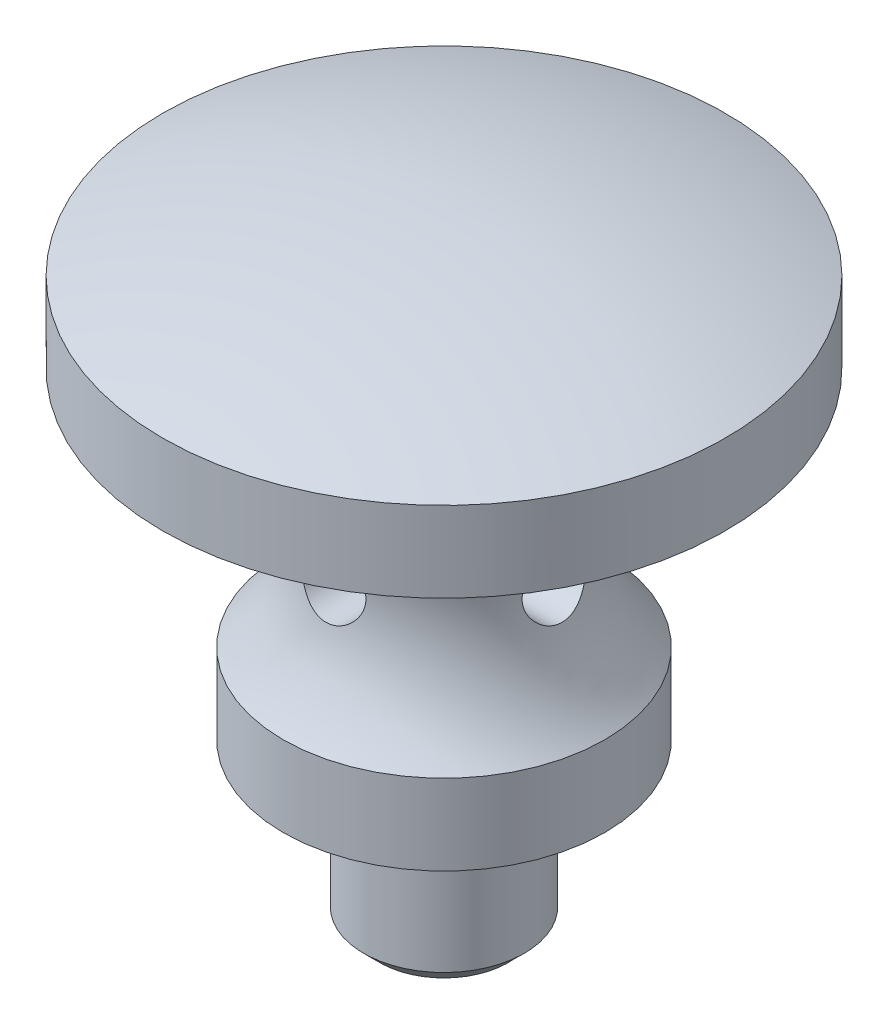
ISO-10303-21;
HEADER;
FILE_DESCRIPTION(('STEP AP214'),'2;1');
FILE_NAME('part.step','',(''),(''),'','','');
FILE_SCHEMA(('AUTOMOTIVE_DESIGN { 1 0 10303 214 1 1 1 1 }'));
ENDSEC;
DATA;
#1=APPLICATION_CONTEXT('core data for automotive mechanical design processes');
#2=APPLICATION_PROTOCOL_DEFINITION('international standard','automotive_design',2000,#1);
#3=PRODUCT_CONTEXT('',#1,'mechanical');
#4=PRODUCT('Part','Part','',(#3));
#5=PRODUCT_RELATED_PRODUCT_CATEGORY('part','',(#4));
#6=PRODUCT_DEFINITION_FORMATION('','',#4);
#7=PRODUCT_DEFINITION_CONTEXT('part definition',#1,'design');
#8=PRODUCT_DEFINITION('design','',#6,#7);
#9=PRODUCT_DEFINITION_SHAPE('','',#8);
#10=(LENGTH_UNIT() NAMED_UNIT(*) SI_UNIT(.MILLI.,.METRE.));
#11=(NAMED_UNIT(*) PLANE_ANGLE_UNIT() SI_UNIT($,.RADIAN.));
#12=(NAMED_UNIT(*) SI_UNIT($,.STERADIAN.) SOLID_ANGLE_UNIT());
#13=UNCERTAINTY_MEASURE_WITH_UNIT(LENGTH_MEASURE(1.E-05),#10,'distance_accuracy_value','');
#14=(GEOMETRIC_REPRESENTATION_CONTEXT(3) GLOBAL_UNCERTAINTY_ASSIGNED_CONTEXT((#13)) GLOBAL_UNIT_ASSIGNED_CONTEXT((#10,
#11,#12)) REPRESENTATION_CONTEXT('',''));
#15=CARTESIAN_POINT('',(0.,0.,0.));
#16=DIRECTION('',(0.,0.,1.));
#17=DIRECTION('',(1.,0.,0.));
#18=AXIS2_PLACEMENT_3D('',#15,#16,#17);
#19=CARTESIAN_POINT('',(0.,22.,17.501));
#20=DIRECTION('',(0.,0.,-1.));
#21=DIRECTION('',(-1.,0.,0.));
#22=AXIS2_PLACEMENT_3D('',#19,#20,#21);
#23=CYLINDRICAL_SURFACE('',#22,2.);
#24=CARTESIAN_POINT('',(0.,22.,0.));
#25=DIRECTION('',(0.,-0.707106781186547,-0.707106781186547));
#26=DIRECTION('',(0.,0.707106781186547,-0.707106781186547));
#27=AXIS2_PLACEMENT_3D('',#24,#25,#26);
#28=ELLIPSE('',#27,2.82842712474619,2.);
#29=CARTESIAN_POINT('',(-1.41421356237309,23.4142135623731,-1.41421356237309));
#30=VERTEX_POINT('',#29);
#31=CARTESIAN_POINT('',(1.4142135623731,23.4142135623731,-1.4142135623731));
#32=VERTEX_POINT('',#31);
#33=EDGE_CURVE('E88',#30,#32,#28,.T.);
#34=ORIENTED_EDGE('',*,*,#33,.F.);
#35=CARTESIAN_POINT('',(0.,22.,0.));
#36=DIRECTION('',(0.707106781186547,0.,-0.707106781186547));
#37=DIRECTION('',(0.707106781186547,0.,0.707106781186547));
#38=AXIS2_PLACEMENT_3D('',#35,#36,#37);
#39=ELLIPSE('',#38,2.82842712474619,2.);
#40=CARTESIAN_POINT('',(-1.41421356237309,20.5857864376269,-1.41421356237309));
#41=VERTEX_POINT('',#40);
#42=EDGE_CURVE('E105',#30,#41,#39,.F.);
#43=ORIENTED_EDGE('',*,*,#42,.T.);
#44=CARTESIAN_POINT('',(0.,22.,0.));
#45=DIRECTION('',(0.,0.707106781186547,-0.707106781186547));
#46=DIRECTION('',(0.,-0.707106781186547,-0.707106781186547));
#47=AXIS2_PLACEMENT_3D('',#44,#45,#46);
#48=ELLIPSE('',#47,2.82842712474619,2.);
#49=CARTESIAN_POINT('',(1.41421356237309,20.5857864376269,-1.41421356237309));
#50=VERTEX_POINT('',#49);
#51=EDGE_CURVE('E47',#50,#41,#48,.T.);
#52=ORIENTED_EDGE('',*,*,#51,.F.);
#53=CARTESIAN_POINT('',(0.,22.,0.));
#54=DIRECTION('',(-0.707106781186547,0.,-0.707106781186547));
#55=DIRECTION('',(-0.707106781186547,0.,0.707106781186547));
#56=AXIS2_PLACEMENT_3D('',#53,#54,#55);
#57=ELLIPSE('',#56,2.82842712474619,2.);
#58=EDGE_CURVE('E125',#32,#50,#57,.T.);
#59=ORIENTED_EDGE('',*,*,#58,.F.);
#60=EDGE_LOOP('',(#34,#43,#52,#59));
#61=FACE_BOUND('',#60,.T.);
#62=CARTESIAN_POINT('',(-1.0355713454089,20.288979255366,-7.21495581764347));
#63=CARTESIAN_POINT('',(-0.946360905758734,20.2349899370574,-7.23723012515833));
#64=CARTESIAN_POINT('',(-0.852502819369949,20.1877333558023,-7.25770293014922));
#65=CARTESIAN_POINT('',(-0.65751453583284,20.108235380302,-7.29300068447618));
#66=CARTESIAN_POINT('',(-0.556376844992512,20.0760097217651,-7.30781971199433));
#67=CARTESIAN_POINT('',(-0.349186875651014,20.0278441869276,-7.33022245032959));
#68=CARTESIAN_POINT('',(-0.243122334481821,20.0119475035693,-7.33778696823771));
#69=CARTESIAN_POINT('',(-0.0295909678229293,19.9973598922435,-7.34472191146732));
#70=CARTESIAN_POINT('',(0.0778750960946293,19.9986599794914,-7.34409661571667));
#71=CARTESIAN_POINT('',(0.286048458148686,20.0179266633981,-7.33495407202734));
#72=CARTESIAN_POINT('',(0.386842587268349,20.035142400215,-7.32679239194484));
#73=CARTESIAN_POINT('',(0.58394233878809,20.084448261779,-7.30394323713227));
#74=CARTESIAN_POINT('',(0.680246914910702,20.11654183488,-7.28925424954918));
#75=CARTESIAN_POINT('',(0.868530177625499,20.1954645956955,-7.25434226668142));
#76=CARTESIAN_POINT('',(0.960332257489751,20.2426538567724,-7.23398581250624));
#77=CARTESIAN_POINT('',(1.13503904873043,20.3500863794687,-7.18983928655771));
#78=CARTESIAN_POINT('',(1.21794004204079,20.4103350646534,-7.16604778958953));
#79=CARTESIAN_POINT('',(1.38043336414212,20.5485235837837,-7.11491768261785));
#80=CARTESIAN_POINT('',(1.45904576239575,20.6275715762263,-7.08745298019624));
#81=CARTESIAN_POINT('',(1.60228861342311,20.7978931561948,-7.03377918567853));
#82=CARTESIAN_POINT('',(1.66691291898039,20.8891720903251,-7.00757064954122));
#83=CARTESIAN_POINT('',(1.78246648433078,21.0855385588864,-6.95842972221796));
#84=CARTESIAN_POINT('',(1.83282549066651,21.1910023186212,-6.9356474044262));
#85=CARTESIAN_POINT('',(1.91464749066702,21.4102674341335,-6.89756404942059));
#86=CARTESIAN_POINT('',(1.94612739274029,21.524061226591,-6.88225632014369));
#87=CARTESIAN_POINT('',(1.98689087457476,21.7469276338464,-6.8622388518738));
#88=CARTESIAN_POINT('',(1.99775822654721,21.855642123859,-6.85677471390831));
#89=CARTESIAN_POINT('',(2.00161323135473,22.0734498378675,-6.85484877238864));
#90=CARTESIAN_POINT('',(1.9946074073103,22.182542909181,-6.85838368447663));
#91=CARTESIAN_POINT('',(1.96424557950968,22.3897693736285,-6.87338511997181));
#92=CARTESIAN_POINT('',(1.94209860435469,22.4881275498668,-6.88426443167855));
#93=CARTESIAN_POINT('',(1.88365035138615,22.6796245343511,-6.91209297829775));
#94=CARTESIAN_POINT('',(1.84734583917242,22.7727621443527,-6.92904360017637));
#95=CARTESIAN_POINT('',(1.75965394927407,22.9562770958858,-6.96822728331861));
#96=CARTESIAN_POINT('',(1.70761334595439,23.0462941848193,-6.99067890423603));
#97=CARTESIAN_POINT('',(1.59063735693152,23.2167882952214,-7.03812496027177));
#98=CARTESIAN_POINT('',(1.52569538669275,23.2972604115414,-7.06312069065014));
#99=CARTESIAN_POINT('',(1.37739469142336,23.4544965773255,-7.11579687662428));
#100=CARTESIAN_POINT('',(1.29286238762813,23.5301497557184,-7.14350323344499));
#101=CARTESIAN_POINT('',(1.11167485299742,23.6664422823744,-7.19625854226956));
#102=CARTESIAN_POINT('',(1.0150176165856,23.7270791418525,-7.22130705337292));
#103=CARTESIAN_POINT('',(0.810860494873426,23.8318771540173,-7.26614535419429));
#104=CARTESIAN_POINT('',(0.70327418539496,23.8758915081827,-7.28588786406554));
#105=CARTESIAN_POINT('',(0.481044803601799,23.9447613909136,-7.31735003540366));
#106=CARTESIAN_POINT('',(0.36640774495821,23.9696330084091,-7.32907643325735));
#107=CARTESIAN_POINT('',(0.144156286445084,23.9976617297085,-7.34233721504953));
#108=CARTESIAN_POINT('',(0.0368033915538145,24.0025261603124,-7.34467255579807));
#109=CARTESIAN_POINT('',(-0.177144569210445,23.995011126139,-7.34109326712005));
#110=CARTESIAN_POINT('',(-0.283739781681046,23.9826350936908,-7.33518027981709));
#111=CARTESIAN_POINT('',(-0.487876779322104,23.9422384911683,-7.31626967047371));
#112=CARTESIAN_POINT('',(-0.585607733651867,23.9149944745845,-7.30362441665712));
#113=CARTESIAN_POINT('',(-0.775062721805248,23.8464648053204,-7.27276135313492));
#114=CARTESIAN_POINT('',(-0.866785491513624,23.8051762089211,-7.25454237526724));
#115=CARTESIAN_POINT('',(-1.04739642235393,23.7070795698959,-7.21304719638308));
#116=CARTESIAN_POINT('',(-1.13582132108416,23.6495180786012,-7.1895411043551));
#117=CARTESIAN_POINT('',(-1.30222430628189,23.5215911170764,-7.14039350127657));
#118=CARTESIAN_POINT('',(-1.38019655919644,23.4512185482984,-7.11475081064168));
#119=CARTESIAN_POINT('',(-1.53049679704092,23.2924917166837,-7.06146856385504));
#120=CARTESIAN_POINT('',(-1.60174876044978,23.2031072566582,-7.0338487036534));
#121=CARTESIAN_POINT('',(-1.72837499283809,23.0128069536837,-6.98196039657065));
#122=CARTESIAN_POINT('',(-1.78374859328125,22.9118906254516,-6.95769209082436));
#123=CARTESIAN_POINT('',(-1.87646675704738,22.7014363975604,-6.91562377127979));
#124=CARTESIAN_POINT('',(-1.91390602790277,22.5919474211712,-6.89778990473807));
#125=CARTESIAN_POINT('',(-1.96940627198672,22.3671592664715,-6.87093272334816));
#126=CARTESIAN_POINT('',(-1.98748619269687,22.2518658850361,-6.86190079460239));
#127=CARTESIAN_POINT('',(-2.0025215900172,22.0309135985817,-6.85439846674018));
#128=CARTESIAN_POINT('',(-2.00136544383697,21.9254117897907,-6.85498387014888));
#129=CARTESIAN_POINT('',(-1.98255407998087,21.7162793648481,-6.8643487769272));
#130=CARTESIAN_POINT('',(-1.96490085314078,21.6126485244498,-6.87312729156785));
#131=CARTESIAN_POINT('',(-1.91481893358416,21.4138080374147,-6.89733338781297));
#132=CARTESIAN_POINT('',(-1.88292978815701,21.3184305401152,-6.91251714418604));
#133=CARTESIAN_POINT('',(-1.8056744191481,21.1342495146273,-6.94786375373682));
#134=CARTESIAN_POINT('',(-1.76029841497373,21.0454508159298,-6.96803021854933));
#135=CARTESIAN_POINT('',(-1.6531414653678,20.8692449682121,-7.01317957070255));
#136=CARTESIAN_POINT('',(-1.59032967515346,20.7825327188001,-7.03842023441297));
#137=CARTESIAN_POINT('',(-1.45197201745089,20.6204689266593,-7.08992053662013));
#138=CARTESIAN_POINT('',(-1.37644373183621,20.5451019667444,-7.11617873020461));
#139=CARTESIAN_POINT('',(-1.25472799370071,20.4416349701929,-7.15446924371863));
#140=CARTESIAN_POINT('',(-1.21272018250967,20.4087237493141,-7.16705828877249));
#141=CARTESIAN_POINT('',(-1.12607516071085,20.3462745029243,-7.19157563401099));
#142=CARTESIAN_POINT('',(-1.08143751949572,20.3167370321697,-7.20350382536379));
#143=CARTESIAN_POINT('',(-1.0355713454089,20.288979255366,-7.21495581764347));
#144=B_SPLINE_CURVE_WITH_KNOTS('',3,(#62,#63,#64,#65,#66,#67,#68,#69,#70,#71,#72,#73,#74,#75,
#76,#77,#78,#79,#80,#81,#82,#83,#84,#85,#86,#87,#88,#89,#90,#91,#92,#93,#94,#95,#96,#97,#98,#99,
#100,#101,#102,#103,#104,#105,#106,#107,#108,#109,#110,#111,#112,#113,#114,#115,#116,#117,#118,
#119,#120,#121,#122,#123,#124,#125,#126,#127,#128,#129,#130,#131,#132,#133,#134,#135,#136,#137,
#138,#139,#140,#141,#142,#143),.UNSPECIFIED.,.T.,.F.,(4,2,2,2,2,2,2,2,2,2,2,2,2,2,2,2,2,2,2,2,2,
2,2,2,2,2,2,2,2,2,2,2,2,2,2,2,2,2,2,2,4),(0.,0.319698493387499,0.639730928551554,
0.960607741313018,1.28131691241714,1.58762791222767,1.89400994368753,2.20832608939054,
2.52277302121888,2.86570342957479,3.20878423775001,3.56409386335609,3.91908479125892,
4.24547892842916,4.57175395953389,4.87462182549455,5.17755892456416,5.49537497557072,
5.81335365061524,6.16207781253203,6.51085973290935,6.86265357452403,7.21415141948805,
7.53493914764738,7.85566302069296,8.16104738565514,8.46649579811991,8.7894392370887,
9.11256216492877,9.46370920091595,9.81487101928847,10.1641574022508,10.5131016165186,
10.8280115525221,11.1428834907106,11.4467195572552,11.7507765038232,12.0794538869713,
12.4076805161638,12.5720215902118,12.7363896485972),.UNSPECIFIED.);
#145=CARTESIAN_POINT('',(-1.0355713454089,20.288979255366,-7.21495581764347));
#146=VERTEX_POINT('',#145);
#147=EDGE_CURVE('E124',#146,#146,#144,.T.);
#148=ORIENTED_EDGE('',*,*,#147,.F.);
#149=EDGE_LOOP('',(#148));
#150=FACE_BOUND('',#149,.T.);
#151=ADVANCED_FACE('F32',(#61,#150),#23,.F.);
#152=CARTESIAN_POINT('',(0.,22.,0.));
#153=DIRECTION('',(0.,1.,0.));
#154=DIRECTION('',(0.,0.,1.));
#155=AXIS2_PLACEMENT_3D('',#152,#153,#154);
#156=TOROIDAL_SURFACE('',#155,17.1414284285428,10.);
#157=CARTESIAN_POINT('',(-7.21495581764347,20.288979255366,-1.0355713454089));
#158=CARTESIAN_POINT('',(-7.19036459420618,20.3485770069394,-1.13402758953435));
#159=CARTESIAN_POINT('',(-7.16352680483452,20.4165062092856,-1.22704274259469));
#160=CARTESIAN_POINT('',(-7.10832087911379,20.5671412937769,-1.4000503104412));
#161=CARTESIAN_POINT('',(-7.07994845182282,20.6498902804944,-1.48000340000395));
#162=CARTESIAN_POINT('',(-7.02486571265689,20.8281883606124,-1.62481747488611));
#163=CARTESIAN_POINT('',(-6.99815508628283,20.9237350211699,-1.6896813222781));
#164=CARTESIAN_POINT('',(-6.94957189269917,21.1254470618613,-1.80235382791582));
#165=CARTESIAN_POINT('',(-6.92769412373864,21.2316008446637,-1.85018085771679));
#166=CARTESIAN_POINT('',(-6.89221791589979,21.4483972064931,-1.92574400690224));
#167=CARTESIAN_POINT('',(-6.87838305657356,21.5587973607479,-1.95405892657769));
#168=CARTESIAN_POINT('',(-6.85994290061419,21.783540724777,-1.99150577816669));
#169=CARTESIAN_POINT('',(-6.85533112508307,21.8978811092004,-2.00065117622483));
#170=CARTESIAN_POINT('',(-6.85598142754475,22.1152048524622,-1.9993425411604));
#171=CARTESIAN_POINT('',(-6.8603237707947,22.2182075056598,-1.99071425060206));
#172=CARTESIAN_POINT('',(-6.87651437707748,22.4210766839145,-1.95786976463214));
#173=CARTESIAN_POINT('',(-6.88836328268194,22.5209429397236,-1.93365223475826));
#174=CARTESIAN_POINT('',(-6.91809559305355,22.7143767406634,-1.87081691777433));
#175=CARTESIAN_POINT('',(-6.93594337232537,22.8079776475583,-1.83228400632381));
#176=CARTESIAN_POINT('',(-6.97584479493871,22.9876165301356,-1.7420469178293));
#177=CARTESIAN_POINT('',(-6.99789992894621,23.0736518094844,-1.690338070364));
#178=CARTESIAN_POINT('',(-7.04634073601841,23.2442672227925,-1.56962170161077));
#179=CARTESIAN_POINT('',(-7.07293842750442,23.327965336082,-1.49945150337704));
#180=CARTESIAN_POINT('',(-7.1260430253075,23.4829150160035,-1.34641420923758));
#181=CARTESIAN_POINT('',(-7.15254987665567,23.5541600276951,-1.26354046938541));
#182=CARTESIAN_POINT('',(-7.20434949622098,23.6864229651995,-1.08138257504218));
#183=CARTESIAN_POINT('',(-7.22947309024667,23.7465669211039,-0.981410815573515));
#184=CARTESIAN_POINT('',(-7.27368474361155,23.8489171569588,-0.771442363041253));
#185=CARTESIAN_POINT('',(-7.29277613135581,23.8911333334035,-0.661451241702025));
#186=CARTESIAN_POINT('',(-7.32163372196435,23.9539009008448,-0.441162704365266));
#187=CARTESIAN_POINT('',(-7.33187079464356,23.975553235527,-0.331242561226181));
#188=CARTESIAN_POINT('',(-7.34352737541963,24.0001583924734,-0.108890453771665));
#189=CARTESIAN_POINT('',(-7.34495200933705,24.0031220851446,0.0035400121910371));
#190=CARTESIAN_POINT('',(-7.33907298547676,23.9907583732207,0.217821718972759));
#191=CARTESIAN_POINT('',(-7.33247733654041,23.9769148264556,0.319782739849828));
#192=CARTESIAN_POINT('',(-7.31244403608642,23.9339946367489,0.519733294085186));
#193=CARTESIAN_POINT('',(-7.2990057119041,23.9049164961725,0.617722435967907));
#194=CARTESIAN_POINT('',(-7.26642529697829,23.8321462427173,0.808588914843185));
#195=CARTESIAN_POINT('',(-7.24720999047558,23.7882655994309,0.901381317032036));
#196=CARTESIAN_POINT('',(-7.20496443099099,23.6873437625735,1.07855291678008));
#197=CARTESIAN_POINT('',(-7.18193271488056,23.6302975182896,1.162928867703));
#198=CARTESIAN_POINT('',(-7.13195878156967,23.4987955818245,1.32882894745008));
#199=CARTESIAN_POINT('',(-7.10485091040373,23.4232444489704,1.40943616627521));
#200=CARTESIAN_POINT('',(-7.05125851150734,23.2597744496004,1.55728080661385));
#201=CARTESIAN_POINT('',(-7.02477431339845,23.1718492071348,1.62451129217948));
#202=CARTESIAN_POINT('',(-6.97406101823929,22.9809505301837,1.74676146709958));
#203=CARTESIAN_POINT('',(-6.9499984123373,22.8774612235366,1.80105094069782));
#204=CARTESIAN_POINT('',(-6.908770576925,22.6614379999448,1.89107435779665));
#205=CARTESIAN_POINT('',(-6.89159990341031,22.5489113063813,1.92682295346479));
#206=CARTESIAN_POINT('',(-6.8675493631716,22.3265167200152,1.97621387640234));
#207=CARTESIAN_POINT('',(-6.86002411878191,22.2170294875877,1.99124833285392));
#208=CARTESIAN_POINT('',(-6.85414432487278,21.9968519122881,2.00302941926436));
#209=CARTESIAN_POINT('',(-6.85578525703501,21.8861621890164,1.99978505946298));
#210=CARTESIAN_POINT('',(-6.86748524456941,21.6762440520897,1.97621649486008));
#211=CARTESIAN_POINT('',(-6.87685161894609,21.5768135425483,1.95729713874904));
#212=CARTESIAN_POINT('',(-6.90201003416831,21.3826945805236,1.90500485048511));
#213=CARTESIAN_POINT('',(-6.91780341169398,21.288007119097,1.87162891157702));
#214=CARTESIAN_POINT('',(-6.95482300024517,21.1021133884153,1.79010588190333));
#215=CARTESIAN_POINT('',(-6.97622682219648,21.0111611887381,1.74146309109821));
#216=CARTESIAN_POINT('',(-7.02201357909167,20.8382880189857,1.6312407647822));
#217=CARTESIAN_POINT('',(-7.04639792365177,20.7563713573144,1.56965509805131));
#218=CARTESIAN_POINT('',(-7.09836642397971,20.5954202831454,1.42819299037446));
#219=CARTESIAN_POINT('',(-7.12602903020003,20.5174663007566,1.34711186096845));
#220=CARTESIAN_POINT('',(-7.17935941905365,20.3759336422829,1.17261750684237));
#221=CARTESIAN_POINT('',(-7.20502660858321,20.3123592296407,1.0792006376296));
#222=CARTESIAN_POINT('',(-7.25210662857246,20.2002038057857,0.879827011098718));
#223=CARTESIAN_POINT('',(-7.2734117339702,20.1519890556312,0.773636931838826));
#224=CARTESIAN_POINT('',(-7.30838676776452,20.0745509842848,0.553389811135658));
#225=CARTESIAN_POINT('',(-7.32206355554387,20.0453105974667,0.439339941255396));
#226=CARTESIAN_POINT('',(-7.33922602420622,20.0088552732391,0.216774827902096));
#227=CARTESIAN_POINT('',(-7.34346133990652,20.0000180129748,0.108582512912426));
#228=CARTESIAN_POINT('',(-7.34347754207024,19.9999820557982,-0.107842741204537));
#229=CARTESIAN_POINT('',(-7.33925706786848,20.0087861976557,-0.216075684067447));
#230=CARTESIAN_POINT('',(-7.3233505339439,20.042579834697,-0.422928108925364));
#231=CARTESIAN_POINT('',(-7.31210735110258,20.0666103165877,-0.52174264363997));
#232=CARTESIAN_POINT('',(-7.28373354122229,20.1289584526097,-0.713693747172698));
#233=CARTESIAN_POINT('',(-7.26661287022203,20.167251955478,-0.806839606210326));
#234=CARTESIAN_POINT('',(-7.2371279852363,20.2358563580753,-0.943739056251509));
#235=CARTESIAN_POINT('',(-7.22628010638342,20.2615344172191,-0.99023212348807));
#236=CARTESIAN_POINT('',(-7.21495581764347,20.288979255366,-1.0355713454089));
#237=B_SPLINE_CURVE_WITH_KNOTS('',3,(#157,#158,#159,#160,#161,#162,#163,#164,#165,#166,#167,
#168,#169,#170,#171,#172,#173,#174,#175,#176,#177,#178,#179,#180,#181,#182,#183,#184,#185,#186,
#187,#188,#189,#190,#191,#192,#193,#194,#195,#196,#197,#198,#199,#200,#201,#202,#203,#204,#205,
#206,#207,#208,#209,#210,#211,#212,#213,#214,#215,#216,#217,#218,#219,#220,#221,#222,#223,#224,
#225,#226,#227,#228,#229,#230,#231,#232,#233,#234,#235,#236),.UNSPECIFIED.,.T.,.F.,(4,2,2,2,2,2,
2,2,2,2,2,2,2,2,2,2,2,2,2,2,2,2,2,2,2,2,2,2,2,2,2,2,2,2,2,2,2,2,2,4),(0.,0.352901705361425,
0.706847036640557,1.06072517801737,1.41422055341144,1.75671743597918,2.09897364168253,
2.40782650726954,2.71670581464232,3.02378227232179,3.33096772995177,3.66676667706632,
4.00274184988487,4.35894459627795,4.71495045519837,5.05059610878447,5.38604651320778,
5.69391620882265,6.00181617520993,6.31379582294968,6.62589535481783,6.96568003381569,
7.30564043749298,7.6617217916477,8.01752131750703,8.34800070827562,8.67831720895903,
8.9818762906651,9.28549853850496,9.60022806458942,9.91510701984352,10.2610305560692,
10.6070565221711,10.9608045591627,11.3142339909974,11.6384183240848,11.9626548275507,
12.2682619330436,12.573353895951,12.7358655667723),.UNSPECIFIED.);
#238=CARTESIAN_POINT('',(-7.21495581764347,20.288979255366,-1.0355713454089));
#239=VERTEX_POINT('',#238);
#240=EDGE_CURVE('E97',#239,#239,#237,.T.);
#241=ORIENTED_EDGE('',*,*,#240,.T.);
#242=EDGE_LOOP('',(#241));
#243=FACE_BOUND('',#242,.T.);
#244=ORIENTED_EDGE('',*,*,#147,.T.);
#245=EDGE_LOOP('',(#244));
#246=FACE_BOUND('',#245,.T.);
#247=CARTESIAN_POINT('',(0.,30.,0.));
#248=DIRECTION('',(0.,1.,0.));
#249=DIRECTION('',(0.,0.,1.));
#250=AXIS2_PLACEMENT_3D('',#247,#248,#249);
#251=CIRCLE('',#250,11.1414284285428);
#252=CARTESIAN_POINT('',(0.,30.,11.1414284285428));
#253=VERTEX_POINT('',#252);
#254=EDGE_CURVE('E213',#253,#253,#251,.T.);
#255=ORIENTED_EDGE('',*,*,#254,.F.);
#256=EDGE_LOOP('',(#255));
#257=FACE_BOUND('',#256,.T.);
#258=CARTESIAN_POINT('',(0.,15.,0.));
#259=DIRECTION('',(0.,1.,0.));
#260=DIRECTION('',(0.,0.,1.));
#261=AXIS2_PLACEMENT_3D('',#258,#259,#260);
#262=CIRCLE('',#261,9.99999999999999);
#263=CARTESIAN_POINT('',(0.,15.,9.99999999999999));
#264=VERTEX_POINT('',#263);
#265=EDGE_CURVE('E217',#264,#264,#262,.T.);
#266=ORIENTED_EDGE('',*,*,#265,.T.);
#267=EDGE_LOOP('',(#266));
#268=FACE_BOUND('',#267,.T.);
#269=CARTESIAN_POINT('',(-1.26401742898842,20.4500774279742,7.15142281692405));
#270=CARTESIAN_POINT('',(-1.18061477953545,20.3820630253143,7.17699887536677));
#271=CARTESIAN_POINT('',(-1.09146328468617,20.3205808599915,7.20170248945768));
#272=CARTESIAN_POINT('',(-0.903461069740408,20.2123920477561,7.24688348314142));
#273=CARTESIAN_POINT('',(-0.804596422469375,20.1657070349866,7.26735465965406));
#274=CARTESIAN_POINT('',(-0.599187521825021,20.0887101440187,7.30189465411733));
#275=CARTESIAN_POINT('',(-0.492619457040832,20.0584517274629,7.31594254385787));
#276=CARTESIAN_POINT('',(-0.275262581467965,20.0159454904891,7.33584903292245));
#277=CARTESIAN_POINT('',(-0.164477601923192,20.0036817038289,7.34171489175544));
#278=CARTESIAN_POINT('',(0.050771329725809,19.99792890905,7.34445669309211));
#279=CARTESIAN_POINT('',(0.155200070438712,20.0033200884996,7.34186885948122));
#280=CARTESIAN_POINT('',(0.361491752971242,20.0301915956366,7.32916361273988));
#281=CARTESIAN_POINT('',(0.46335443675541,20.0516735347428,7.31904544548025));
#282=CARTESIAN_POINT('',(0.66025090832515,20.1093795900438,7.29256906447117));
#283=CARTESIAN_POINT('',(0.755363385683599,20.1453810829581,7.27630530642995));
#284=CARTESIAN_POINT('',(0.938310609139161,20.2308821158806,7.23910186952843));
#285=CARTESIAN_POINT('',(1.02614331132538,20.2803854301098,7.21816088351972));
#286=CARTESIAN_POINT('',(1.19943121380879,20.3959299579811,7.17171318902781));
#287=CARTESIAN_POINT('',(1.2841648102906,20.462960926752,7.14597761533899));
#288=CARTESIAN_POINT('',(1.44169079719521,20.6096321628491,7.0937289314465));
#289=CARTESIAN_POINT('',(1.51447600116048,20.689279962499,7.0672153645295));
#290=CARTESIAN_POINT('',(1.6512465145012,20.8656723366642,7.01419467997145));
#291=CARTESIAN_POINT('',(1.71424404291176,20.9632280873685,6.98782090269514));
#292=CARTESIAN_POINT('',(1.82279693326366,21.1687940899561,6.94036384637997));
#293=CARTESIAN_POINT('',(1.8683596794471,21.2767998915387,6.91927832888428));
#294=CARTESIAN_POINT('',(1.93859721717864,21.4955580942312,6.8860028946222));
#295=CARTESIAN_POINT('',(1.96408038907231,21.6059966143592,6.87347177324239));
#296=CARTESIAN_POINT('',(1.99598769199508,21.8302119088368,6.85769595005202));
#297=CARTESIAN_POINT('',(2.00242691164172,21.9439859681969,6.85444389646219));
#298=CARTESIAN_POINT('',(1.99623777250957,22.1599148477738,6.85753315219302));
#299=CARTESIAN_POINT('',(1.9853764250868,22.2621389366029,6.86298554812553));
#300=CARTESIAN_POINT('',(1.94832939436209,22.4630910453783,6.88117192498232));
#301=CARTESIAN_POINT('',(1.92214162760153,22.5618185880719,6.89390689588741));
#302=CARTESIAN_POINT('',(1.85537370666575,22.7536197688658,6.92525840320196));
#303=CARTESIAN_POINT('',(1.81474566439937,22.8466733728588,6.9438944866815));
#304=CARTESIAN_POINT('',(1.72038473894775,23.0249176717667,6.98512535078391));
#305=CARTESIAN_POINT('',(1.66664690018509,23.1101053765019,7.00772162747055));
#306=CARTESIAN_POINT('',(1.54160874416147,23.2788666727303,7.05705639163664));
#307=CARTESIAN_POINT('',(1.4691198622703,23.3615056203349,7.08398434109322));
#308=CARTESIAN_POINT('',(1.31149543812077,23.5139384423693,7.13736741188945));
#309=CARTESIAN_POINT('',(1.22635371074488,23.5837259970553,7.1638222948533));
#310=CARTESIAN_POINT('',(1.04030074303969,23.712075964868,7.21490108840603));
#311=CARTESIAN_POINT('',(0.938793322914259,23.7698486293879,7.23935394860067));
#312=CARTESIAN_POINT('',(0.726153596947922,23.8671764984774,7.28184523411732));
#313=CARTESIAN_POINT('',(0.615027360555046,23.9067430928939,7.2998876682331));
#314=CARTESIAN_POINT('',(0.393804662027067,23.9639564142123,7.32635304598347));
#315=CARTESIAN_POINT('',(0.284094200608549,23.9828397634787,7.33531592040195));
#316=CARTESIAN_POINT('',(0.0627191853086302,24.0020969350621,7.34445803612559));
#317=CARTESIAN_POINT('',(-0.04894432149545,24.0024803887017,7.34464184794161));
#318=CARTESIAN_POINT('',(-0.261730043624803,23.985445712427,7.33655192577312));
#319=CARTESIAN_POINT('',(-0.362993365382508,23.96941827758,7.32893890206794));
#320=CARTESIAN_POINT('',(-0.561204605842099,23.9223497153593,7.3070678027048));
#321=CARTESIAN_POINT('',(-0.658152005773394,23.8913067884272,7.29280893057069));
#322=CARTESIAN_POINT('',(-0.847393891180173,23.8145448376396,7.25870315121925));
#323=CARTESIAN_POINT('',(-0.939548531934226,23.7685322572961,7.23874553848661));
#324=CARTESIAN_POINT('',(-1.11513430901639,23.663417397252,7.19525964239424));
#325=CARTESIAN_POINT('',(-1.19856183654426,23.6043097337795,7.17172989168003));
#326=CARTESIAN_POINT('',(-1.36228880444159,23.4684948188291,7.12098709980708));
#327=CARTESIAN_POINT('',(-1.44162904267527,23.390681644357,7.09363321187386));
#328=CARTESIAN_POINT('',(-1.58654552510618,23.2227756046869,7.03995367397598));
#329=CARTESIAN_POINT('',(-1.65211528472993,23.1326769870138,7.01362851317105));
#330=CARTESIAN_POINT('',(-1.77008623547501,22.9382058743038,6.96388863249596));
#331=CARTESIAN_POINT('',(-1.82185706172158,22.8334070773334,6.94063209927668));
#332=CARTESIAN_POINT('',(-1.90661467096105,22.615212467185,6.90140013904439));
#333=CARTESIAN_POINT('',(-1.939617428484,22.5018240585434,6.88541852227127));
#334=CARTESIAN_POINT('',(-1.98343171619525,22.2790527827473,6.86396298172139));
#335=CARTESIAN_POINT('',(-1.99576288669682,22.1700389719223,6.85777162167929));
#336=CARTESIAN_POINT('',(-2.00239463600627,21.9513547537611,6.85445870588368));
#337=CARTESIAN_POINT('',(-1.99670415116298,21.8416846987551,6.85733265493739));
#338=CARTESIAN_POINT('',(-1.9687288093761,21.6335235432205,6.87118011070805));
#339=CARTESIAN_POINT('',(-1.94772692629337,21.5348128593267,6.88152686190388));
#340=CARTESIAN_POINT('',(-1.8914584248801,21.3423978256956,6.90842054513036));
#341=CARTESIAN_POINT('',(-1.8561826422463,21.2486967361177,6.92497145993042));
#342=CARTESIAN_POINT('',(-1.77064061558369,21.0642423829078,6.96342039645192));
#343=CARTESIAN_POINT('',(-1.71976526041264,20.9738173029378,6.98552747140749));
#344=CARTESIAN_POINT('',(-1.60514920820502,20.802459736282,7.03241460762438));
#345=CARTESIAN_POINT('',(-1.5414253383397,20.7215150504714,7.05719115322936));
#346=CARTESIAN_POINT('',(-1.43971897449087,20.6109415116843,7.093763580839));
#347=CARTESIAN_POINT('',(-1.40622037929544,20.5770405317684,7.10540729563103));
#348=CARTESIAN_POINT('',(-1.33686408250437,20.5116903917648,7.12856548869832));
#349=CARTESIAN_POINT('',(-1.3010061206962,20.4802415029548,7.14007995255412));
#350=CARTESIAN_POINT('',(-1.26401742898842,20.4500774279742,7.15142281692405));
#351=B_SPLINE_CURVE_WITH_KNOTS('',3,(#269,#270,#271,#272,#273,#274,#275,#276,#277,#278,#279,
#280,#281,#282,#283,#284,#285,#286,#287,#288,#289,#290,#291,#292,#293,#294,#295,#296,#297,#298,
#299,#300,#301,#302,#303,#304,#305,#306,#307,#308,#309,#310,#311,#312,#313,#314,#315,#316,#317,
#318,#319,#320,#321,#322,#323,#324,#325,#326,#327,#328,#329,#330,#331,#332,#333,#334,#335,#336,
#337,#338,#339,#340,#341,#342,#343,#344,#345,#346,#347,#348,#349,#350),.UNSPECIFIED.,.T.,.F.,(4,
2,2,2,2,2,2,2,2,2,2,2,2,2,2,2,2,2,2,2,2,2,2,2,2,2,2,2,2,2,2,2,2,2,2,2,2,2,2,2,4),(0.,
0.331683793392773,0.663850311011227,0.997091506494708,1.33003684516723,1.64228325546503,
1.95456094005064,2.26222232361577,2.56996979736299,2.9017557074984,3.23374044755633,
3.58922801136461,3.94456484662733,4.28473844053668,4.6246424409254,4.93199442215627,
5.23938819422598,5.54781103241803,5.85635063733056,6.19441718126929,6.5326495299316,
6.88878608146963,7.24469952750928,7.57792281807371,7.91097262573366,8.21795998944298,
8.52498415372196,8.8384339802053,9.15201291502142,9.49384696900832,9.83584163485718,
10.1914921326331,10.5468394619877,10.874688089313,11.2023741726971,11.505363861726,
11.8085483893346,12.1255297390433,12.4420986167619,12.5891826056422,12.7362828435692),.UNSPECIFIED.);
#352=CARTESIAN_POINT('',(-1.26401742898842,20.4500774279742,7.15142281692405));
#353=VERTEX_POINT('',#352);
#354=EDGE_CURVE('E132',#353,#353,#351,.T.);
#355=ORIENTED_EDGE('',*,*,#354,.F.);
#356=EDGE_LOOP('',(#355));
#357=FACE_BOUND('',#356,.T.);
#358=CARTESIAN_POINT('',(7.15142281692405,20.4500774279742,-1.26401742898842));
#359=CARTESIAN_POINT('',(7.1245146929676,20.521631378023,-1.35174807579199));
#360=CARTESIAN_POINT('',(7.09659131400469,20.6005481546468,-1.43329210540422));
#361=CARTESIAN_POINT('',(7.04168205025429,20.7713750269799,-1.58220327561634));
#362=CARTESIAN_POINT('',(7.01469865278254,20.8633167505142,-1.64953488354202));
#363=CARTESIAN_POINT('',(6.96472206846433,21.0583612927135,-1.76815115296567));
#364=CARTESIAN_POINT('',(6.94173751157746,21.1614874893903,-1.81940129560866));
#365=CARTESIAN_POINT('',(6.90278842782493,21.3760933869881,-1.90367946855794));
#366=CARTESIAN_POINT('',(6.88681455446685,21.4875617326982,-1.93673177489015));
#367=CARTESIAN_POINT('',(6.86486245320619,21.7083619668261,-1.98162425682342));
#368=CARTESIAN_POINT('',(6.85832321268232,21.8173938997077,-1.99465826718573));
#369=CARTESIAN_POINT('',(6.85432435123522,22.0362786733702,-2.00266437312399));
#370=CARTESIAN_POINT('',(6.85686204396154,22.1461312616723,-1.99764181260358));
#371=CARTESIAN_POINT('',(6.87011544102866,22.3546934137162,-1.97088953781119));
#372=CARTESIAN_POINT('',(6.88019497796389,22.4536153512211,-1.95045853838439));
#373=CARTESIAN_POINT('',(6.9066133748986,22.6464907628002,-1.89528801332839));
#374=CARTESIAN_POINT('',(6.92295350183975,22.7404432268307,-1.86054559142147));
#375=CARTESIAN_POINT('',(6.96099541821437,22.9252222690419,-1.77615301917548));
#376=CARTESIAN_POINT('',(6.98289588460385,23.0157453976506,-1.72593107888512));
#377=CARTESIAN_POINT('',(7.02947497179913,23.1875250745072,-1.61257146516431));
#378=CARTESIAN_POINT('',(7.05415495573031,23.2687770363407,-1.54942744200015));
#379=CARTESIAN_POINT('',(7.10648425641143,23.4280347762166,-1.40477400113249));
#380=CARTESIAN_POINT('',(7.13418766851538,23.5049433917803,-1.32207161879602));
#381=CARTESIAN_POINT('',(7.18729213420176,23.6440864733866,-1.14442608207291));
#382=CARTESIAN_POINT('',(7.21269265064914,23.7063175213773,-1.04948008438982));
#383=CARTESIAN_POINT('',(7.25876740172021,23.8150828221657,-0.847818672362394));
#384=CARTESIAN_POINT('',(7.27935979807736,23.8613509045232,-0.740939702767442));
#385=CARTESIAN_POINT('',(7.31272064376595,23.934809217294,-0.519682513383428));
#386=CARTESIAN_POINT('',(7.3254955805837,23.9620152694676,-0.405310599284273));
#387=CARTESIAN_POINT('',(7.34083814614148,23.9945245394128,-0.182814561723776));
#388=CARTESIAN_POINT('',(7.344181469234,24.0014937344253,-0.0749863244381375));
#389=CARTESIAN_POINT('',(7.34250333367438,23.9979729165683,0.140304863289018));
#390=CARTESIAN_POINT('',(7.33748392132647,23.987487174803,0.247767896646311));
#391=CARTESIAN_POINT('',(7.32016387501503,23.9506009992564,0.453297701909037));
#392=CARTESIAN_POINT('',(7.3082666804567,23.9250809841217,0.551559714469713));
#393=CARTESIAN_POINT('',(7.27872922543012,23.8598693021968,0.742330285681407));
#394=CARTESIAN_POINT('',(7.26108784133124,23.8201748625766,0.83483771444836));
#395=CARTESIAN_POINT('',(7.22066639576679,23.7254429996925,1.01681602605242));
#396=CARTESIAN_POINT('',(7.19766604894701,23.6697124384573,1.10587588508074));
#397=CARTESIAN_POINT('',(7.14928794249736,23.5454093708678,1.27382824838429));
#398=CARTESIAN_POINT('',(7.12390891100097,23.4768299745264,1.35271525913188));
#399=CARTESIAN_POINT('',(7.07083196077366,23.321658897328,1.50535129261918));
#400=CARTESIAN_POINT('',(7.04312754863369,23.2340103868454,1.57802815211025));
#401=CARTESIAN_POINT('',(6.99069244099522,23.0470268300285,1.70783082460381));
#402=CARTESIAN_POINT('',(6.96596211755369,22.9476903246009,1.76495469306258));
#403=CARTESIAN_POINT('',(6.92242791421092,22.7393565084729,1.86187215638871));
#404=CARTESIAN_POINT('',(6.90363666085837,22.6303392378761,1.9016288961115));
#405=CARTESIAN_POINT('',(6.87469110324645,22.4060255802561,1.96178255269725));
#406=CARTESIAN_POINT('',(6.86452817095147,22.2907355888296,1.98219881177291));
#407=CARTESIAN_POINT('',(6.85486662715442,22.0691263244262,2.0015962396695));
#408=CARTESIAN_POINT('',(6.85443780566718,21.9630085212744,2.00244721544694));
#409=CARTESIAN_POINT('',(6.86193779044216,21.7522769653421,1.98740712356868));
#410=CARTESIAN_POINT('',(6.86986591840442,21.6476630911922,1.97151741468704));
#411=CARTESIAN_POINT('',(6.8925667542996,21.4473577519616,1.92476684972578));
#412=CARTESIAN_POINT('',(6.90703805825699,21.3514760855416,1.89456269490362));
#413=CARTESIAN_POINT('',(6.94114584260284,21.1660917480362,1.82059475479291));
#414=CARTESIAN_POINT('',(6.96078375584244,21.07659085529,1.77682720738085));
#415=CARTESIAN_POINT('',(7.00495505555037,20.8991590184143,1.6731681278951));
#416=CARTESIAN_POINT('',(7.0297464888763,20.8118597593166,1.61230684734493));
#417=CARTESIAN_POINT('',(7.08066263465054,20.6481714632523,1.47776736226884));
#418=CARTESIAN_POINT('',(7.10678809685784,20.5717886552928,1.40408189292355));
#419=CARTESIAN_POINT('',(7.16005558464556,20.42553700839,1.23864867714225));
#420=CARTESIAN_POINT('',(7.18709882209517,20.3567533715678,1.14590389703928));
#421=CARTESIAN_POINT('',(7.23682179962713,20.2357544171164,0.949089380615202));
#422=CARTESIAN_POINT('',(7.25950232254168,20.1835361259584,0.845021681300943));
#423=CARTESIAN_POINT('',(7.29728178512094,20.0987620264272,0.631021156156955));
#424=CARTESIAN_POINT('',(7.31256135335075,20.0657333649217,0.521309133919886));
#425=CARTESIAN_POINT('',(7.33445226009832,20.0188771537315,0.297058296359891));
#426=CARTESIAN_POINT('',(7.34107111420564,20.0050329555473,0.18252375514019));
#427=CARTESIAN_POINT('',(7.34461015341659,19.9976070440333,-0.0368521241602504));
#428=CARTESIAN_POINT('',(7.34235933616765,20.0022935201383,-0.141625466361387));
#429=CARTESIAN_POINT('',(7.33025221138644,20.0278798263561,-0.348758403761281));
#430=CARTESIAN_POINT('',(7.32039284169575,20.0487861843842,-0.451117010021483));
#431=CARTESIAN_POINT('',(7.29437703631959,20.105396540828,-0.648743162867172));
#432=CARTESIAN_POINT('',(7.27833631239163,20.1408293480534,-0.744104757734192));
#433=CARTESIAN_POINT('',(7.241530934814,20.2251973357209,-0.927492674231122));
#434=CARTESIAN_POINT('',(7.2207732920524,20.2741124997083,-1.0155296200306));
#435=CARTESIAN_POINT('',(7.18343377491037,20.3666419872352,-1.15621198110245));
#436=CARTESIAN_POINT('',(7.16761204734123,20.4070271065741,-1.21123442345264));
#437=CARTESIAN_POINT('',(7.15142281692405,20.4500774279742,-1.26401742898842));
#438=B_SPLINE_CURVE_WITH_KNOTS('',3,(#358,#359,#360,#361,#362,#363,#364,#365,#366,#367,#368,
#369,#370,#371,#372,#373,#374,#375,#376,#377,#378,#379,#380,#381,#382,#383,#384,#385,#386,#387,
#388,#389,#390,#391,#392,#393,#394,#395,#396,#397,#398,#399,#400,#401,#402,#403,#404,#405,#406,
#407,#408,#409,#410,#411,#412,#413,#414,#415,#416,#417,#418,#419,#420,#421,#422,#423,#424,#425,
#426,#427,#428,#429,#430,#431,#432,#433,#434,#435,#436,#437),.UNSPECIFIED.,.T.,.F.,(4,2,2,2,2,2,
2,2,2,2,2,2,2,2,2,2,2,2,2,2,2,2,2,2,2,2,2,2,2,2,2,2,2,2,2,2,2,2,2,4),(0.,0.348879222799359,
0.698620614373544,1.0491076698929,1.39912603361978,1.72732587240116,2.05542858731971,
2.35859623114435,2.66182525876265,2.97796600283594,3.29426246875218,3.64153441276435,
3.98888714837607,4.34177966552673,4.69437892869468,5.01699092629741,5.33952399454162,
5.64482104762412,5.95017785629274,6.27148506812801,6.59296507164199,6.94288912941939,
7.29285691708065,7.64356381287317,7.99391959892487,8.31063733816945,8.6273293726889,
8.93072260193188,9.23420005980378,9.56064987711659,9.88728523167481,10.2413422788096,
10.5953357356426,10.9401894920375,11.2847437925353,11.5978937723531,11.9111698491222,
12.2188460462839,12.5260678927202,12.7359705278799),.UNSPECIFIED.);
#439=CARTESIAN_POINT('',(7.15142281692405,20.4500774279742,-1.26401742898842));
#440=VERTEX_POINT('',#439);
#441=EDGE_CURVE('E118',#440,#440,#438,.T.);
#442=ORIENTED_EDGE('',*,*,#441,.F.);
#443=EDGE_LOOP('',(#442));
#444=FACE_BOUND('',#443,.T.);
#445=ADVANCED_FACE('F146',(#243,#246,#257,#268,#357,#444),#156,.F.);
#446=CARTESIAN_POINT('',(0.,22.,0.));
#447=DIRECTION('',(0.,-0.707106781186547,-0.707106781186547));
#448=DIRECTION('',(0.,0.707106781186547,-0.707106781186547));
#449=AXIS2_PLACEMENT_3D('',#446,#447,#448);
#450=ELLIPSE('',#449,2.82842712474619,2.);
#451=CARTESIAN_POINT('',(-1.41421356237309,20.5857864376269,1.41421356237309));
#452=VERTEX_POINT('',#451);
#453=CARTESIAN_POINT('',(1.41421356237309,20.5857864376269,1.41421356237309));
#454=VERTEX_POINT('',#453);
#455=EDGE_CURVE('E92',#452,#454,#450,.F.);
#456=ORIENTED_EDGE('',*,*,#455,.F.);
#457=CARTESIAN_POINT('',(0.,22.,0.));
#458=DIRECTION('',(0.707106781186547,0.,0.707106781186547));
#459=DIRECTION('',(0.707106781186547,0.,-0.707106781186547));
#460=AXIS2_PLACEMENT_3D('',#457,#458,#459);
#461=ELLIPSE('',#460,2.82842712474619,2.);
#462=CARTESIAN_POINT('',(-1.41421356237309,23.4142135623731,1.41421356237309));
#463=VERTEX_POINT('',#462);
#464=EDGE_CURVE('E104',#452,#463,#461,.F.);
#465=ORIENTED_EDGE('',*,*,#464,.T.);
#466=CARTESIAN_POINT('',(0.,22.,0.));
#467=DIRECTION('',(0.,0.707106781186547,-0.707106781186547));
#468=DIRECTION('',(0.,-0.707106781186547,-0.707106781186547));
#469=AXIS2_PLACEMENT_3D('',#466,#467,#468);
#470=ELLIPSE('',#469,2.82842712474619,2.);
#471=CARTESIAN_POINT('',(1.4142135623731,23.4142135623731,1.4142135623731));
#472=VERTEX_POINT('',#471);
#473=EDGE_CURVE('E54',#472,#463,#470,.F.);
#474=ORIENTED_EDGE('',*,*,#473,.F.);
#475=CARTESIAN_POINT('',(0.,22.,0.));
#476=DIRECTION('',(-0.707106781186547,0.,0.707106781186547));
#477=DIRECTION('',(-0.707106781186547,0.,-0.707106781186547));
#478=AXIS2_PLACEMENT_3D('',#475,#476,#477);
#479=ELLIPSE('',#478,2.82842712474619,2.);
#480=EDGE_CURVE('E235',#454,#472,#479,.T.);
#481=ORIENTED_EDGE('',*,*,#480,.F.);
#482=EDGE_LOOP('',(#456,#465,#474,#481));
#483=FACE_BOUND('',#482,.T.);
#484=ORIENTED_EDGE('',*,*,#354,.T.);
#485=EDGE_LOOP('',(#484));
#486=FACE_BOUND('',#485,.T.);
#487=ADVANCED_FACE('F141',(#483,#486),#23,.F.);
#488=CARTESIAN_POINT('',(0.,-11.837484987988,0.));
#489=DIRECTION('',(0.,1.,0.));
#490=DIRECTION('',(-1.,0.,0.));
#491=AXIS2_PLACEMENT_3D('',#488,#489,#490);
#492=SPHERICAL_SURFACE('',#491,50.);
#493=CARTESIAN_POINT('',(0.,35.,0.));
#494=DIRECTION('',(0.,1.,0.));
#495=DIRECTION('',(0.,0.,1.));
#496=AXIS2_PLACEMENT_3D('',#493,#494,#495);
#497=CIRCLE('',#496,17.5);
#498=CARTESIAN_POINT('',(0.,35.,17.5));
#499=VERTEX_POINT('',#498);
#500=EDGE_CURVE('E260',#499,#499,#497,.T.);
#501=ORIENTED_EDGE('',*,*,#500,.T.);
#502=EDGE_LOOP('',(#501));
#503=FACE_BOUND('',#502,.T.);
#504=ADVANCED_FACE('F145',(#503),#492,.T.);
#505=CARTESIAN_POINT('',(0.,75.0506660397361,0.));
#506=DIRECTION('',(0.,1.,0.));
#507=DIRECTION('',(0.,0.,1.));
#508=AXIS2_PLACEMENT_3D('',#505,#506,#507);
#509=CYLINDRICAL_SURFACE('',#508,17.5);
#510=CARTESIAN_POINT('',(0.,30.,0.));
#511=DIRECTION('',(0.,1.,0.));
#512=DIRECTION('',(0.,0.,1.));
#513=AXIS2_PLACEMENT_3D('',#510,#511,#512);
#514=CIRCLE('',#513,17.5);
#515=CARTESIAN_POINT('',(0.,30.,17.5));
#516=VERTEX_POINT('',#515);
#517=EDGE_CURVE('E263',#516,#516,#514,.T.);
#518=ORIENTED_EDGE('',*,*,#517,.T.);
#519=EDGE_LOOP('',(#518));
#520=FACE_BOUND('',#519,.T.);
#521=ORIENTED_EDGE('',*,*,#500,.F.);
#522=EDGE_LOOP('',(#521));
#523=FACE_BOUND('',#522,.T.);
#524=ADVANCED_FACE('F180',(#520,#523),#509,.T.);
#525=CARTESIAN_POINT('',(-11.1414284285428,30.,0.));
#526=DIRECTION('',(0.,-1.,0.));
#527=DIRECTION('',(0.,0.,-1.));
#528=AXIS2_PLACEMENT_3D('',#525,#526,#527);
#529=PLANE('',#528);
#530=ORIENTED_EDGE('',*,*,#254,.T.);
#531=EDGE_LOOP('',(#530));
#532=FACE_BOUND('',#531,.T.);
#533=ORIENTED_EDGE('',*,*,#517,.F.);
#534=EDGE_LOOP('',(#533));
#535=FACE_BOUND('',#534,.T.);
#536=ADVANCED_FACE('F173',(#532,#535),#529,.T.);
#537=CARTESIAN_POINT('',(0.,75.0506660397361,0.));
#538=DIRECTION('',(0.,1.,0.));
#539=DIRECTION('',(0.,0.,1.));
#540=AXIS2_PLACEMENT_3D('',#537,#538,#539);
#541=CYLINDRICAL_SURFACE('',#540,9.99999999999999);
#542=CARTESIAN_POINT('',(0.,9.99999999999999,0.));
#543=DIRECTION('',(0.,1.,0.));
#544=DIRECTION('',(0.,0.,1.));
#545=AXIS2_PLACEMENT_3D('',#542,#543,#544);
#546=CIRCLE('',#545,9.99999999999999);
#547=CARTESIAN_POINT('',(0.,9.99999999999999,9.99999999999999));
#548=VERTEX_POINT('',#547);
#549=EDGE_CURVE('E268',#548,#548,#546,.T.);
#550=ORIENTED_EDGE('',*,*,#549,.T.);
#551=EDGE_LOOP('',(#550));
#552=FACE_BOUND('',#551,.T.);
#553=ORIENTED_EDGE('',*,*,#265,.F.);
#554=EDGE_LOOP('',(#553));
#555=FACE_BOUND('',#554,.T.);
#556=ADVANCED_FACE('F169',(#552,#555),#541,.T.);
#557=CARTESIAN_POINT('',(-4.99999999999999,10.,0.));
#558=DIRECTION('',(0.,-1.,0.));
#559=DIRECTION('',(0.,0.,-1.));
#560=AXIS2_PLACEMENT_3D('',#557,#558,#559);
#561=PLANE('',#560);
#562=CARTESIAN_POINT('',(0.,10.,0.));
#563=DIRECTION('',(0.,-1.,0.));
#564=DIRECTION('',(0.,0.,-1.));
#565=AXIS2_PLACEMENT_3D('',#562,#563,#564);
#566=CIRCLE('',#565,5.);
#567=CARTESIAN_POINT('',(0.,10.,-5.));
#568=VERTEX_POINT('',#567);
#569=EDGE_CURVE('E241',#568,#568,#566,.F.);
#570=ORIENTED_EDGE('',*,*,#569,.T.);
#571=EDGE_LOOP('',(#570));
#572=FACE_BOUND('',#571,.T.);
#573=ORIENTED_EDGE('',*,*,#549,.F.);
#574=EDGE_LOOP('',(#573));
#575=FACE_BOUND('',#574,.T.);
#576=ADVANCED_FACE('F156',(#572,#575),#561,.T.);
#577=CARTESIAN_POINT('',(0.,-5.30498751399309,0.));
#578=DIRECTION('',(0.,-1.,0.));
#579=DIRECTION('',(0.,0.,-1.));
#580=AXIS2_PLACEMENT_3D('',#577,#578,#579);
#581=CYLINDRICAL_SURFACE('',#580,4.5);
#582=CARTESIAN_POINT('',(0.,9.20710678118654,0.));
#583=DIRECTION('',(0.,-1.,0.));
#584=DIRECTION('',(0.,0.,-1.));
#585=AXIS2_PLACEMENT_3D('',#582,#583,#584);
#586=CIRCLE('',#585,4.5);
#587=CARTESIAN_POINT('',(0.,9.20710678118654,-4.5));
#588=VERTEX_POINT('',#587);
#589=EDGE_CURVE('E243',#588,#588,#586,.F.);
#590=ORIENTED_EDGE('',*,*,#589,.T.);
#591=EDGE_LOOP('',(#590));
#592=FACE_BOUND('',#591,.T.);
#593=CARTESIAN_POINT('',(0.,9.5,0.));
#594=DIRECTION('',(0.,-1.,0.));
#595=DIRECTION('',(0.,0.,-1.));
#596=AXIS2_PLACEMENT_3D('',#593,#594,#595);
#597=CIRCLE('',#596,4.5);
#598=CARTESIAN_POINT('',(0.,9.5,-4.5));
#599=VERTEX_POINT('',#598);
#600=EDGE_CURVE('E248',#599,#599,#597,.T.);
#601=ORIENTED_EDGE('',*,*,#600,.T.);
#602=EDGE_LOOP('',(#601));
#603=FACE_BOUND('',#602,.T.);
#604=ADVANCED_FACE('F152',(#592,#603),#581,.T.);
#605=CARTESIAN_POINT('',(0.,8.5,0.));
#606=DIRECTION('',(0.,-1.,0.));
#607=DIRECTION('',(0.,0.,-1.));
#608=AXIS2_PLACEMENT_3D('',#605,#606,#607);
#609=CONICAL_SURFACE('',#608,4.99999999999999,0.785398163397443);
#610=CARTESIAN_POINT('',(0.,8.85355339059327,0.));
#611=DIRECTION('',(0.,-1.,0.));
#612=DIRECTION('',(0.,0.,-1.));
#613=AXIS2_PLACEMENT_3D('',#610,#611,#612);
#614=CIRCLE('',#613,4.64644660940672);
#615=CARTESIAN_POINT('',(0.,8.85355339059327,-4.64644660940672));
#616=VERTEX_POINT('',#615);
#617=EDGE_CURVE('E251',#616,#616,#614,.T.);
#618=ORIENTED_EDGE('',*,*,#617,.T.);
#619=EDGE_LOOP('',(#618));
#620=FACE_BOUND('',#619,.T.);
#621=CARTESIAN_POINT('',(0.,8.5,0.));
#622=DIRECTION('',(0.,-1.,0.));
#623=DIRECTION('',(0.,0.,-1.));
#624=AXIS2_PLACEMENT_3D('',#621,#622,#623);
#625=CIRCLE('',#624,4.99999999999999);
#626=CARTESIAN_POINT('',(0.,8.5,-4.99999999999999));
#627=VERTEX_POINT('',#626);
#628=EDGE_CURVE('E270',#627,#627,#625,.T.);
#629=ORIENTED_EDGE('',*,*,#628,.F.);
#630=EDGE_LOOP('',(#629));
#631=FACE_BOUND('',#630,.T.);
#632=ADVANCED_FACE('F148',(#620,#631),#609,.T.);
#633=CARTESIAN_POINT('',(0.,0.,0.));
#634=DIRECTION('',(0.,-1.,0.));
#635=DIRECTION('',(0.,0.,-1.));
#636=AXIS2_PLACEMENT_3D('',#633,#634,#635);
#637=PLANE('',#636);
#638=CARTESIAN_POINT('',(0.,0.,0.));
#639=DIRECTION('',(0.,-1.,0.));
#640=DIRECTION('',(0.,0.,-1.));
#641=AXIS2_PLACEMENT_3D('',#638,#639,#640);
#642=CIRCLE('',#641,2.);
#643=CARTESIAN_POINT('',(0.,0.,-2.));
#644=VERTEX_POINT('',#643);
#645=EDGE_CURVE('E82',#644,#644,#642,.T.);
#646=ORIENTED_EDGE('',*,*,#645,.F.);
#647=EDGE_LOOP('',(#646));
#648=FACE_BOUND('',#647,.T.);
#649=CARTESIAN_POINT('',(0.,0.,0.));
#650=DIRECTION('',(0.,-1.,0.));
#651=DIRECTION('',(0.,0.,-1.));
#652=AXIS2_PLACEMENT_3D('',#649,#650,#651);
#653=CIRCLE('',#652,3.99999999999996);
#654=CARTESIAN_POINT('',(0.,0.,-3.99999999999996));
#655=VERTEX_POINT('',#654);
#656=EDGE_CURVE('E254',#655,#655,#653,.T.);
#657=ORIENTED_EDGE('',*,*,#656,.T.);
#658=EDGE_LOOP('',(#657));
#659=FACE_BOUND('',#658,.T.);
#660=ADVANCED_FACE('F151',(#648,#659),#637,.T.);
#661=CARTESIAN_POINT('',(0.,1.00000000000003,0.));
#662=DIRECTION('',(0.,1.,0.));
#663=DIRECTION('',(0.,0.,1.));
#664=AXIS2_PLACEMENT_3D('',#661,#662,#663);
#665=CONICAL_SURFACE('',#664,4.99999999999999,0.785398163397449);
#666=ORIENTED_EDGE('',*,*,#656,.F.);
#667=EDGE_LOOP('',(#666));
#668=FACE_BOUND('',#667,.T.);
#669=CARTESIAN_POINT('',(0.,1.00000000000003,0.));
#670=DIRECTION('',(0.,-1.,0.));
#671=DIRECTION('',(0.,0.,-1.));
#672=AXIS2_PLACEMENT_3D('',#669,#670,#671);
#673=CIRCLE('',#672,4.99999999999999);
#674=CARTESIAN_POINT('',(0.,1.00000000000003,-4.99999999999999));
#675=VERTEX_POINT('',#674);
#676=EDGE_CURVE('E257',#675,#675,#673,.F.);
#677=ORIENTED_EDGE('',*,*,#676,.F.);
#678=EDGE_LOOP('',(#677));
#679=FACE_BOUND('',#678,.T.);
#680=ADVANCED_FACE('F160',(#668,#679),#665,.T.);
#681=CARTESIAN_POINT('',(0.,75.0506660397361,0.));
#682=DIRECTION('',(0.,1.,0.));
#683=DIRECTION('',(0.,0.,1.));
#684=AXIS2_PLACEMENT_3D('',#681,#682,#683);
#685=CYLINDRICAL_SURFACE('',#684,4.99999999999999);
#686=ORIENTED_EDGE('',*,*,#676,.T.);
#687=EDGE_LOOP('',(#686));
#688=FACE_BOUND('',#687,.T.);
#689=ORIENTED_EDGE('',*,*,#628,.T.);
#690=EDGE_LOOP('',(#689));
#691=FACE_BOUND('',#690,.T.);
#692=ADVANCED_FACE('F162',(#688,#691),#685,.T.);
#693=CARTESIAN_POINT('',(0.,9.20710678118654,0.));
#694=DIRECTION('',(0.,-1.,0.));
#695=DIRECTION('',(0.,0.,-1.));
#696=AXIS2_PLACEMENT_3D('',#693,#694,#695);
#697=TOROIDAL_SURFACE('',#696,5.,0.5);
#698=ORIENTED_EDGE('',*,*,#589,.F.);
#699=EDGE_LOOP('',(#698));
#700=FACE_BOUND('',#699,.T.);
#701=ORIENTED_EDGE('',*,*,#617,.F.);
#702=EDGE_LOOP('',(#701));
#703=FACE_BOUND('',#702,.T.);
#704=ADVANCED_FACE('F165',(#700,#703),#697,.F.);
#705=CARTESIAN_POINT('',(0.,9.5,0.));
#706=DIRECTION('',(0.,-1.,0.));
#707=DIRECTION('',(0.,0.,-1.));
#708=AXIS2_PLACEMENT_3D('',#705,#706,#707);
#709=TOROIDAL_SURFACE('',#708,5.,0.5);
#710=ORIENTED_EDGE('',*,*,#569,.F.);
#711=EDGE_LOOP('',(#710));
#712=FACE_BOUND('',#711,.T.);
#713=ORIENTED_EDGE('',*,*,#600,.F.);
#714=EDGE_LOOP('',(#713));
#715=FACE_BOUND('',#714,.T.);
#716=ADVANCED_FACE('F34',(#712,#715),#709,.F.);
#717=CARTESIAN_POINT('',(17.501,22.,0.));
#718=DIRECTION('',(-1.,0.,0.));
#719=DIRECTION('',(0.,0.,1.));
#720=AXIS2_PLACEMENT_3D('',#717,#718,#719);
#721=CYLINDRICAL_SURFACE('',#720,2.);
#722=CARTESIAN_POINT('',(0.,22.,0.));
#723=DIRECTION('',(-0.707106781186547,-0.707106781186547,0.));
#724=DIRECTION('',(-0.707106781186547,0.707106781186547,0.));
#725=AXIS2_PLACEMENT_3D('',#722,#723,#724);
#726=ELLIPSE('',#725,2.82842712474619,2.);
#727=EDGE_CURVE('E95',#454,#50,#726,.F.);
#728=ORIENTED_EDGE('',*,*,#727,.F.);
#729=ORIENTED_EDGE('',*,*,#480,.T.);
#730=CARTESIAN_POINT('',(0.,22.,0.));
#731=DIRECTION('',(-0.707106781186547,0.707106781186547,0.));
#732=DIRECTION('',(-0.707106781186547,-0.707106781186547,0.));
#733=AXIS2_PLACEMENT_3D('',#730,#731,#732);
#734=ELLIPSE('',#733,2.82842712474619,2.);
#735=EDGE_CURVE('E90',#32,#472,#734,.F.);
#736=ORIENTED_EDGE('',*,*,#735,.F.);
#737=ORIENTED_EDGE('',*,*,#58,.T.);
#738=EDGE_LOOP('',(#728,#729,#736,#737));
#739=FACE_BOUND('',#738,.T.);
#740=ORIENTED_EDGE('',*,*,#441,.T.);
#741=EDGE_LOOP('',(#740));
#742=FACE_BOUND('',#741,.T.);
#743=ADVANCED_FACE('F114',(#739,#742),#721,.F.);
#744=CARTESIAN_POINT('',(-17.501,22.,0.));
#745=DIRECTION('',(1.,0.,0.));
#746=DIRECTION('',(0.,0.,-1.));
#747=AXIS2_PLACEMENT_3D('',#744,#745,#746);
#748=CYLINDRICAL_SURFACE('',#747,2.);
#749=ORIENTED_EDGE('',*,*,#240,.F.);
#750=EDGE_LOOP('',(#749));
#751=FACE_BOUND('',#750,.T.);
#752=ORIENTED_EDGE('',*,*,#464,.F.);
#753=CARTESIAN_POINT('',(0.,22.,0.));
#754=DIRECTION('',(0.707106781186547,-0.707106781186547,0.));
#755=DIRECTION('',(0.707106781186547,0.707106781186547,0.));
#756=AXIS2_PLACEMENT_3D('',#753,#754,#755);
#757=ELLIPSE('',#756,2.82842712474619,2.);
#758=EDGE_CURVE('E11',#452,#41,#757,.T.);
#759=ORIENTED_EDGE('',*,*,#758,.T.);
#760=ORIENTED_EDGE('',*,*,#42,.F.);
#761=CARTESIAN_POINT('',(0.,22.,0.));
#762=DIRECTION('',(0.707106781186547,0.707106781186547,0.));
#763=DIRECTION('',(0.707106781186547,-0.707106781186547,0.));
#764=AXIS2_PLACEMENT_3D('',#761,#762,#763);
#765=ELLIPSE('',#764,2.82842712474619,2.);
#766=EDGE_CURVE('E40',#30,#463,#765,.T.);
#767=ORIENTED_EDGE('',*,*,#766,.T.);
#768=EDGE_LOOP('',(#752,#759,#760,#767));
#769=FACE_BOUND('',#768,.T.);
#770=ADVANCED_FACE('F107',(#751,#769),#748,.F.);
#771=CARTESIAN_POINT('',(0.,25.,0.));
#772=DIRECTION('',(0.,-1.,0.));
#773=DIRECTION('',(0.,0.,-1.));
#774=AXIS2_PLACEMENT_3D('',#771,#772,#773);
#775=CYLINDRICAL_SURFACE('',#774,2.);
#776=ORIENTED_EDGE('',*,*,#735,.T.);
#777=ORIENTED_EDGE('',*,*,#473,.T.);
#778=ORIENTED_EDGE('',*,*,#766,.F.);
#779=ORIENTED_EDGE('',*,*,#33,.T.);
#780=EDGE_LOOP('',(#776,#777,#778,#779));
#781=FACE_BOUND('',#780,.T.);
#782=CARTESIAN_POINT('',(0.,25.,0.));
#783=DIRECTION('',(0.,-1.,0.));
#784=DIRECTION('',(0.,0.,-1.));
#785=AXIS2_PLACEMENT_3D('',#782,#783,#784);
#786=CIRCLE('',#785,2.);
#787=CARTESIAN_POINT('',(0.,25.,-2.));
#788=VERTEX_POINT('',#787);
#789=EDGE_CURVE('E80',#788,#788,#786,.T.);
#790=ORIENTED_EDGE('',*,*,#789,.F.);
#791=EDGE_LOOP('',(#790));
#792=FACE_BOUND('',#791,.T.);
#793=ADVANCED_FACE('F228',(#781,#792),#775,.F.);
#794=ORIENTED_EDGE('',*,*,#727,.T.);
#795=ORIENTED_EDGE('',*,*,#51,.T.);
#796=ORIENTED_EDGE('',*,*,#758,.F.);
#797=ORIENTED_EDGE('',*,*,#455,.T.);
#798=EDGE_LOOP('',(#794,#795,#796,#797));
#799=FACE_BOUND('',#798,.T.);
#800=ORIENTED_EDGE('',*,*,#645,.T.);
#801=EDGE_LOOP('',(#800));
#802=FACE_BOUND('',#801,.T.);
#803=ADVANCED_FACE('F76',(#799,#802),#775,.F.);
#804=CARTESIAN_POINT('',(0.,25.,0.));
#805=DIRECTION('',(0.,-1.,0.));
#806=DIRECTION('',(0.,0.,-1.));
#807=AXIS2_PLACEMENT_3D('',#804,#805,#806);
#808=CONICAL_SURFACE('',#807,2.,1.0471975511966);
#809=CARTESIAN_POINT('',(0.,26.1547005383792,0.));
#810=VERTEX_POINT('',#809);
#811=VERTEX_LOOP('',#810);
#812=FACE_BOUND('',#811,.T.);
#813=ORIENTED_EDGE('',*,*,#789,.T.);
#814=EDGE_LOOP('',(#813));
#815=FACE_BOUND('',#814,.T.);
#816=ADVANCED_FACE('F73',(#812,#815),#808,.F.);
#817=CLOSED_SHELL('',(#151,#445,#487,#504,#524,#536,#556,#576,#604,#632,#660,#680,#692,#704,
#716,#743,#770,#793,#803,#816));
#818=MANIFOLD_SOLID_BREP('B2',#817);
#819=ADVANCED_BREP_SHAPE_REPRESENTATION('',(#18,#818),#14);
#820=SHAPE_DEFINITION_REPRESENTATION(#9,#819);
ENDSEC;
END-ISO-10303-21;
